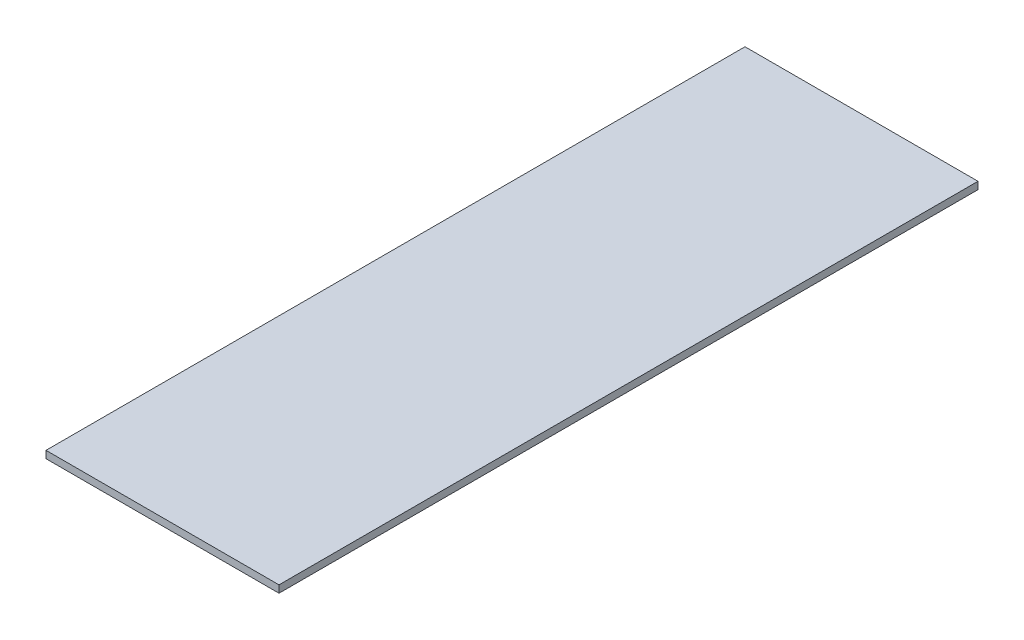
ISO-10303-21;
HEADER;
FILE_DESCRIPTION(('STEP AP214'),'2;1');
FILE_NAME('part.step','',(''),(''),'','','');
FILE_SCHEMA(('AUTOMOTIVE_DESIGN { 1 0 10303 214 1 1 1 1 }'));
ENDSEC;
DATA;
#1=APPLICATION_CONTEXT('core data for automotive mechanical design processes');
#2=APPLICATION_PROTOCOL_DEFINITION('international standard','automotive_design',2000,#1);
#3=PRODUCT_CONTEXT('',#1,'mechanical');
#4=PRODUCT('Part','Part','',(#3));
#5=PRODUCT_RELATED_PRODUCT_CATEGORY('part','',(#4));
#6=PRODUCT_DEFINITION_FORMATION('','',#4);
#7=PRODUCT_DEFINITION_CONTEXT('part definition',#1,'design');
#8=PRODUCT_DEFINITION('design','',#6,#7);
#9=PRODUCT_DEFINITION_SHAPE('','',#8);
#10=(LENGTH_UNIT() NAMED_UNIT(*) SI_UNIT(.MILLI.,.METRE.));
#11=(NAMED_UNIT(*) PLANE_ANGLE_UNIT() SI_UNIT($,.RADIAN.));
#12=(NAMED_UNIT(*) SI_UNIT($,.STERADIAN.) SOLID_ANGLE_UNIT());
#13=UNCERTAINTY_MEASURE_WITH_UNIT(LENGTH_MEASURE(1.E-05),#10,'distance_accuracy_value','');
#14=(GEOMETRIC_REPRESENTATION_CONTEXT(3) GLOBAL_UNCERTAINTY_ASSIGNED_CONTEXT((#13)) GLOBAL_UNIT_ASSIGNED_CONTEXT((#10,
#11,#12)) REPRESENTATION_CONTEXT('',''));
#15=CARTESIAN_POINT('',(0.,0.,0.));
#16=DIRECTION('',(0.,0.,1.));
#17=DIRECTION('',(1.,0.,0.));
#18=AXIS2_PLACEMENT_3D('',#15,#16,#17);
#19=CARTESIAN_POINT('',(76.2000000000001,4.7625,228.6));
#20=DIRECTION('',(-1.,0.,0.));
#21=DIRECTION('',(0.,0.,1.));
#22=AXIS2_PLACEMENT_3D('',#19,#20,#21);
#23=PLANE('',#22);
#24=DIRECTION('',(0.,0.,-1.));
#25=VECTOR('',#24,1.);
#26=CARTESIAN_POINT('',(76.2000000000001,0.,228.6));
#27=LINE('',#26,#25);
#28=CARTESIAN_POINT('',(76.2000000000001,0.,228.6));
#29=VERTEX_POINT('',#28);
#30=CARTESIAN_POINT('',(76.1999999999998,-3.33066907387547E-13,-228.6));
#31=VERTEX_POINT('',#30);
#32=EDGE_CURVE('E107',#29,#31,#27,.T.);
#33=ORIENTED_EDGE('',*,*,#32,.T.);
#34=DIRECTION('',(0.,-1.,0.));
#35=VECTOR('',#34,1.);
#36=CARTESIAN_POINT('',(76.1999999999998,4.76249999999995,-228.6));
#37=LINE('',#36,#35);
#38=CARTESIAN_POINT('',(76.1999999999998,4.76249999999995,-228.6));
#39=VERTEX_POINT('',#38);
#40=EDGE_CURVE('E11',#39,#31,#37,.T.);
#41=ORIENTED_EDGE('',*,*,#40,.F.);
#42=DIRECTION('',(0.,0.,-1.));
#43=VECTOR('',#42,1.);
#44=CARTESIAN_POINT('',(76.2000000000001,4.7625,228.6));
#45=LINE('',#44,#43);
#46=CARTESIAN_POINT('',(76.2000000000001,4.7625,228.6));
#47=VERTEX_POINT('',#46);
#48=EDGE_CURVE('E90',#47,#39,#45,.T.);
#49=ORIENTED_EDGE('',*,*,#48,.F.);
#50=DIRECTION('',(0.,-1.,0.));
#51=VECTOR('',#50,1.);
#52=CARTESIAN_POINT('',(76.2000000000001,4.7625,228.6));
#53=LINE('',#52,#51);
#54=EDGE_CURVE('E103',#47,#29,#53,.T.);
#55=ORIENTED_EDGE('',*,*,#54,.T.);
#56=EDGE_LOOP('',(#33,#41,#49,#55));
#57=FACE_BOUND('',#56,.T.);
#58=ADVANCED_FACE('F38',(#57),#23,.F.);
#59=CARTESIAN_POINT('',(-76.2000000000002,4.76249999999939,-228.6));
#60=DIRECTION('',(0.,0.,1.));
#61=DIRECTION('',(1.,0.,0.));
#62=AXIS2_PLACEMENT_3D('',#59,#60,#61);
#63=PLANE('',#62);
#64=DIRECTION('',(-1.,0.,0.));
#65=VECTOR('',#64,1.);
#66=CARTESIAN_POINT('',(-76.2000000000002,-6.66133814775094E-13,-228.6));
#67=LINE('',#66,#65);
#68=CARTESIAN_POINT('',(-76.2000000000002,-6.66133814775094E-13,-228.6));
#69=VERTEX_POINT('',#68);
#70=EDGE_CURVE('E95',#31,#69,#67,.T.);
#71=ORIENTED_EDGE('',*,*,#70,.T.);
#72=DIRECTION('',(0.,-1.,0.));
#73=VECTOR('',#72,1.);
#74=CARTESIAN_POINT('',(-76.2000000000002,4.76249999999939,-228.6));
#75=LINE('',#74,#73);
#76=CARTESIAN_POINT('',(-76.2000000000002,4.76249999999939,-228.6));
#77=VERTEX_POINT('',#76);
#78=EDGE_CURVE('E47',#77,#69,#75,.T.);
#79=ORIENTED_EDGE('',*,*,#78,.F.);
#80=DIRECTION('',(-1.,0.,0.));
#81=VECTOR('',#80,1.);
#82=CARTESIAN_POINT('',(-76.2000000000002,4.76249999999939,-228.6));
#83=LINE('',#82,#81);
#84=EDGE_CURVE('E85',#39,#77,#83,.T.);
#85=ORIENTED_EDGE('',*,*,#84,.F.);
#86=ORIENTED_EDGE('',*,*,#40,.T.);
#87=EDGE_LOOP('',(#71,#79,#85,#86));
#88=FACE_BOUND('',#87,.T.);
#89=ADVANCED_FACE('F94',(#88),#63,.F.);
#90=CARTESIAN_POINT('',(-76.1999999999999,4.76249999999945,228.6));
#91=DIRECTION('',(1.,0.,0.));
#92=DIRECTION('',(0.,0.,-1.));
#93=AXIS2_PLACEMENT_3D('',#90,#91,#92);
#94=PLANE('',#93);
#95=DIRECTION('',(0.,0.,1.));
#96=VECTOR('',#95,1.);
#97=CARTESIAN_POINT('',(-76.1999999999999,-3.33066907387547E-13,228.6));
#98=LINE('',#97,#96);
#99=CARTESIAN_POINT('',(-76.1999999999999,-3.33066907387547E-13,228.6));
#100=VERTEX_POINT('',#99);
#101=EDGE_CURVE('E72',#69,#100,#98,.T.);
#102=ORIENTED_EDGE('',*,*,#101,.T.);
#103=DIRECTION('',(0.,-1.,0.));
#104=VECTOR('',#103,1.);
#105=CARTESIAN_POINT('',(-76.1999999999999,4.76249999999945,228.6));
#106=LINE('',#105,#104);
#107=CARTESIAN_POINT('',(-76.1999999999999,4.76249999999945,228.6));
#108=VERTEX_POINT('',#107);
#109=EDGE_CURVE('E97',#108,#100,#106,.T.);
#110=ORIENTED_EDGE('',*,*,#109,.F.);
#111=DIRECTION('',(0.,0.,1.));
#112=VECTOR('',#111,1.);
#113=CARTESIAN_POINT('',(-76.1999999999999,4.76249999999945,228.6));
#114=LINE('',#113,#112);
#115=EDGE_CURVE('E88',#77,#108,#114,.T.);
#116=ORIENTED_EDGE('',*,*,#115,.F.);
#117=ORIENTED_EDGE('',*,*,#78,.T.);
#118=EDGE_LOOP('',(#102,#110,#116,#117));
#119=FACE_BOUND('',#118,.T.);
#120=ADVANCED_FACE('F98',(#119),#94,.F.);
#121=CARTESIAN_POINT('',(-76.1999999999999,4.76249999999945,228.6));
#122=DIRECTION('',(0.,0.,-1.));
#123=DIRECTION('',(-1.,0.,0.));
#124=AXIS2_PLACEMENT_3D('',#121,#122,#123);
#125=PLANE('',#124);
#126=DIRECTION('',(1.,0.,0.));
#127=VECTOR('',#126,1.);
#128=CARTESIAN_POINT('',(-76.1999999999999,-3.33066907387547E-13,228.6));
#129=LINE('',#128,#127);
#130=EDGE_CURVE('E78',#100,#29,#129,.T.);
#131=ORIENTED_EDGE('',*,*,#130,.T.);
#132=ORIENTED_EDGE('',*,*,#54,.F.);
#133=DIRECTION('',(1.,0.,0.));
#134=VECTOR('',#133,1.);
#135=CARTESIAN_POINT('',(-76.1999999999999,4.76249999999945,228.6));
#136=LINE('',#135,#134);
#137=EDGE_CURVE('E55',#108,#47,#136,.T.);
#138=ORIENTED_EDGE('',*,*,#137,.F.);
#139=ORIENTED_EDGE('',*,*,#109,.T.);
#140=EDGE_LOOP('',(#131,#132,#138,#139));
#141=FACE_BOUND('',#140,.T.);
#142=ADVANCED_FACE('F121',(#141),#125,.F.);
#143=CARTESIAN_POINT('',(0.,4.7625,0.));
#144=DIRECTION('',(0.,-1.,0.));
#145=DIRECTION('',(0.,0.,-1.));
#146=AXIS2_PLACEMENT_3D('',#143,#144,#145);
#147=PLANE('',#146);
#148=ORIENTED_EDGE('',*,*,#48,.T.);
#149=ORIENTED_EDGE('',*,*,#84,.T.);
#150=ORIENTED_EDGE('',*,*,#115,.T.);
#151=ORIENTED_EDGE('',*,*,#137,.T.);
#152=EDGE_LOOP('',(#148,#149,#150,#151));
#153=FACE_BOUND('',#152,.T.);
#154=ADVANCED_FACE('F86',(#153),#147,.F.);
#155=CARTESIAN_POINT('',(0.,0.,0.));
#156=DIRECTION('',(0.,-1.,0.));
#157=DIRECTION('',(0.,0.,-1.));
#158=AXIS2_PLACEMENT_3D('',#155,#156,#157);
#159=PLANE('',#158);
#160=ORIENTED_EDGE('',*,*,#32,.F.);
#161=ORIENTED_EDGE('',*,*,#130,.F.);
#162=ORIENTED_EDGE('',*,*,#101,.F.);
#163=ORIENTED_EDGE('',*,*,#70,.F.);
#164=EDGE_LOOP('',(#160,#161,#162,#163));
#165=FACE_BOUND('',#164,.T.);
#166=ADVANCED_FACE('F124',(#165),#159,.T.);
#167=CLOSED_SHELL('',(#58,#89,#120,#142,#154,#166));
#168=MANIFOLD_SOLID_BREP('B2',#167);
#169=ADVANCED_BREP_SHAPE_REPRESENTATION('',(#18,#168),#14);
#170=SHAPE_DEFINITION_REPRESENTATION(#9,#169);
ENDSEC;
END-ISO-10303-21;
